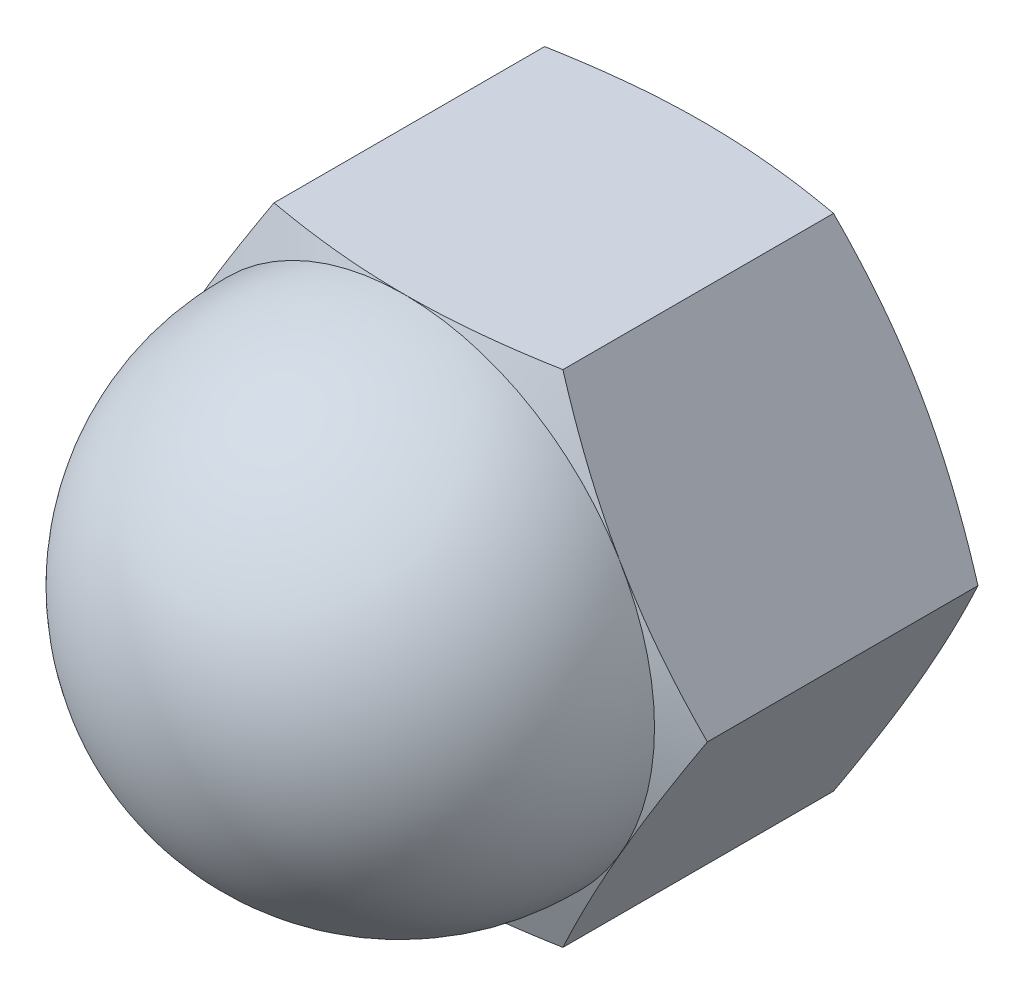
ISO-10303-21;
HEADER;
FILE_DESCRIPTION(('STEP AP214'),'2;1');
FILE_NAME('part.step','',(''),(''),'','','');
FILE_SCHEMA(('AUTOMOTIVE_DESIGN { 1 0 10303 214 1 1 1 1 }'));
ENDSEC;
DATA;
#1=APPLICATION_CONTEXT('core data for automotive mechanical design processes');
#2=APPLICATION_PROTOCOL_DEFINITION('international standard','automotive_design',2000,#1);
#3=PRODUCT_CONTEXT('',#1,'mechanical');
#4=PRODUCT('Part','Part','',(#3));
#5=PRODUCT_RELATED_PRODUCT_CATEGORY('part','',(#4));
#6=PRODUCT_DEFINITION_FORMATION('','',#4);
#7=PRODUCT_DEFINITION_CONTEXT('part definition',#1,'design');
#8=PRODUCT_DEFINITION('design','',#6,#7);
#9=PRODUCT_DEFINITION_SHAPE('','',#8);
#10=(LENGTH_UNIT() NAMED_UNIT(*) SI_UNIT(.MILLI.,.METRE.));
#11=(NAMED_UNIT(*) PLANE_ANGLE_UNIT() SI_UNIT($,.RADIAN.));
#12=(NAMED_UNIT(*) SI_UNIT($,.STERADIAN.) SOLID_ANGLE_UNIT());
#13=UNCERTAINTY_MEASURE_WITH_UNIT(LENGTH_MEASURE(1.E-05),#10,'distance_accuracy_value','');
#14=(GEOMETRIC_REPRESENTATION_CONTEXT(3) GLOBAL_UNCERTAINTY_ASSIGNED_CONTEXT((#13)) GLOBAL_UNIT_ASSIGNED_CONTEXT((#10,
#11,#12)) REPRESENTATION_CONTEXT('',''));
#15=CARTESIAN_POINT('',(0.,0.,0.));
#16=DIRECTION('',(0.,0.,1.));
#17=DIRECTION('',(1.,0.,0.));
#18=AXIS2_PLACEMENT_3D('',#15,#16,#17);
#19=CARTESIAN_POINT('',(0.,0.,-8.));
#20=DIRECTION('',(0.,0.,1.));
#21=DIRECTION('',(1.,0.,0.));
#22=AXIS2_PLACEMENT_3D('',#19,#20,#21);
#23=CYLINDRICAL_SURFACE('',#22,3.3235);
#24=CARTESIAN_POINT('',(0.,0.,-7.1235));
#25=DIRECTION('',(0.,0.,1.));
#26=DIRECTION('',(1.,0.,0.));
#27=AXIS2_PLACEMENT_3D('',#24,#25,#26);
#28=CIRCLE('',#27,3.3235);
#29=CARTESIAN_POINT('',(3.3235,0.,-7.1235));
#30=VERTEX_POINT('',#29);
#31=EDGE_CURVE('E11',#30,#30,#28,.F.);
#32=ORIENTED_EDGE('',*,*,#31,.T.);
#33=EDGE_LOOP('',(#32));
#34=FACE_BOUND('',#33,.T.);
#35=CARTESIAN_POINT('',(0.,0.,-2.));
#36=DIRECTION('',(0.,0.,1.));
#37=DIRECTION('',(1.,0.,0.));
#38=AXIS2_PLACEMENT_3D('',#35,#36,#37);
#39=CIRCLE('',#38,3.3235);
#40=CARTESIAN_POINT('',(3.3235,0.,-2.));
#41=VERTEX_POINT('',#40);
#42=EDGE_CURVE('E124',#41,#41,#39,.F.);
#43=ORIENTED_EDGE('',*,*,#42,.F.);
#44=EDGE_LOOP('',(#43));
#45=FACE_BOUND('',#44,.T.);
#46=ADVANCED_FACE('F30',(#34,#45),#23,.F.);
#47=CARTESIAN_POINT('',(0.,0.,0.));
#48=DIRECTION('',(0.,0.,-1.));
#49=DIRECTION('',(-1.,0.,0.));
#50=AXIS2_PLACEMENT_3D('',#47,#48,#49);
#51=CONICAL_SURFACE('',#50,6.175,1.22173047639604);
#52=CARTESIAN_POINT('',(3.75266127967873,-6.5002,-0.484323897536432));
#53=CARTESIAN_POINT('',(3.90808152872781,-6.23100423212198,-0.427734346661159));
#54=CARTESIAN_POINT('',(4.06401428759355,-5.96092077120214,-0.376256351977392));
#55=CARTESIAN_POINT('',(4.37689369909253,-5.41899773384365,-0.285688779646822));
#56=CARTESIAN_POINT('',(4.53384104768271,-5.14715695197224,-0.246608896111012));
#57=CARTESIAN_POINT('',(4.84700787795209,-4.60473609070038,-0.183398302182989));
#58=CARTESIAN_POINT('',(5.00322020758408,-4.33416839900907,-0.159129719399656));
#59=CARTESIAN_POINT('',(5.31601017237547,-3.79240028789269,-0.126578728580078));
#60=CARTESIAN_POINT('',(5.47258764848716,-3.52120014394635,-0.118290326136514));
#61=CARTESIAN_POINT('',(5.78574260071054,-2.97879985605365,-0.118290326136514));
#62=CARTESIAN_POINT('',(5.94232007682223,-2.7075997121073,-0.126578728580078));
#63=CARTESIAN_POINT('',(6.25511004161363,-2.16583160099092,-0.159129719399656));
#64=CARTESIAN_POINT('',(6.41132237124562,-1.89526390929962,-0.183398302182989));
#65=CARTESIAN_POINT('',(6.72448920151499,-1.35284304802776,-0.246608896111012));
#66=CARTESIAN_POINT('',(6.88143655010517,-1.08100226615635,-0.285688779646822));
#67=CARTESIAN_POINT('',(7.19431596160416,-0.539079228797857,-0.376256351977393));
#68=CARTESIAN_POINT('',(7.35024872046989,-0.268995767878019,-0.427734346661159));
#69=CARTESIAN_POINT('',(7.50566896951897,0.000200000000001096,-0.484323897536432));
#70=B_SPLINE_CURVE_WITH_KNOTS('',3,(#52,#53,#54,#55,#56,#57,#58,#59,#60,#61,#62,#63,#64,#65,#66,
#67,#68,#69),.UNSPECIFIED.,.F.,.F.,(4,2,2,2,2,2,2,2,4),(0.,0.947946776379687,1.89663293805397,
2.83634783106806,3.77571015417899,4.71507247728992,5.65478737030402,6.6034735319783,
7.55142030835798),.UNSPECIFIED.);
#71=CARTESIAN_POINT('',(3.75277674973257,-6.5,-0.484281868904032));
#72=VERTEX_POINT('',#71);
#73=CARTESIAN_POINT('',(7.50555349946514,0.,-0.484281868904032));
#74=VERTEX_POINT('',#73);
#75=EDGE_CURVE('E45',#72,#74,#70,.T.);
#76=ORIENTED_EDGE('',*,*,#75,.T.);
#77=CARTESIAN_POINT('',(7.50566896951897,-0.000199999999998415,-0.484323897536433));
#78=CARTESIAN_POINT('',(7.35024872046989,0.268995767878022,-0.427734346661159));
#79=CARTESIAN_POINT('',(7.19431596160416,0.53907922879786,-0.376256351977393));
#80=CARTESIAN_POINT('',(6.88143655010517,1.08100226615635,-0.285688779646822));
#81=CARTESIAN_POINT('',(6.72448920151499,1.35284304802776,-0.246608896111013));
#82=CARTESIAN_POINT('',(6.41132237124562,1.89526390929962,-0.183398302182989));
#83=CARTESIAN_POINT('',(6.25511004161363,2.16583160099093,-0.159129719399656));
#84=CARTESIAN_POINT('',(5.94232007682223,2.70759971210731,-0.126578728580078));
#85=CARTESIAN_POINT('',(5.78574260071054,2.97879985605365,-0.118290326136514));
#86=CARTESIAN_POINT('',(5.47258764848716,3.52120014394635,-0.118290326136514));
#87=CARTESIAN_POINT('',(5.31601017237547,3.79240028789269,-0.126578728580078));
#88=CARTESIAN_POINT('',(5.00322020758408,4.33416839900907,-0.159129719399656));
#89=CARTESIAN_POINT('',(4.84700787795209,4.60473609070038,-0.183398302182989));
#90=CARTESIAN_POINT('',(4.53384104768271,5.14715695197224,-0.246608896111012));
#91=CARTESIAN_POINT('',(4.37689369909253,5.41899773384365,-0.285688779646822));
#92=CARTESIAN_POINT('',(4.06401428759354,5.96092077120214,-0.376256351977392));
#93=CARTESIAN_POINT('',(3.90808152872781,6.23100423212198,-0.427734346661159));
#94=CARTESIAN_POINT('',(3.75266127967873,6.5002,-0.484323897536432));
#95=B_SPLINE_CURVE_WITH_KNOTS('',3,(#77,#78,#79,#80,#81,#82,#83,#84,#85,#86,#87,#88,#89,#90,#91,
#92,#93,#94),.UNSPECIFIED.,.F.,.F.,(4,2,2,2,2,2,2,2,4),(0.,0.947946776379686,1.89663293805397,
2.83634783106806,3.77571015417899,4.71507247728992,5.65478737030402,6.6034735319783,
7.55142030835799),.UNSPECIFIED.);
#96=CARTESIAN_POINT('',(3.75277674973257,6.5,-0.484281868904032));
#97=VERTEX_POINT('',#96);
#98=EDGE_CURVE('E190',#74,#97,#95,.T.);
#99=ORIENTED_EDGE('',*,*,#98,.T.);
#100=CARTESIAN_POINT('',(-9.9247690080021,6.5,-2.07057364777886));
#101=CARTESIAN_POINT('',(-9.63080077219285,6.5,-1.98109093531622));
#102=CARTESIAN_POINT('',(-9.33650800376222,6.5,-1.89265487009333));
#103=CARTESIAN_POINT('',(-8.74710820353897,6.5,-1.71845507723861));
#104=CARTESIAN_POINT('',(-8.45200110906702,6.5,-1.6326915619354));
#105=CARTESIAN_POINT('',(-7.86029986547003,6.5,-1.46427255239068));
#106=CARTESIAN_POINT('',(-7.56370396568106,6.5,-1.38162318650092));
#107=CARTESIAN_POINT('',(-6.96940726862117,6.5,-1.22040301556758));
#108=CARTESIAN_POINT('',(-6.67170649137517,6.5,-1.14183213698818));
#109=CARTESIAN_POINT('',(-6.07870150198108,6.5,-0.990721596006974));
#110=CARTESIAN_POINT('',(-5.78341334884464,6.5,-0.918119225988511));
#111=CARTESIAN_POINT('',(-5.19136638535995,6.5,-0.77911271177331));
#112=CARTESIAN_POINT('',(-4.8946075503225,6.5,-0.712708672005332));
#113=CARTESIAN_POINT('',(-4.29955488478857,6.5,-0.587650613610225));
#114=CARTESIAN_POINT('',(-4.00126162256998,6.5,-0.528993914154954));
#115=CARTESIAN_POINT('',(-3.40294390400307,6.5,-0.421219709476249));
#116=CARTESIAN_POINT('',(-3.10291950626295,6.5,-0.372101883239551));
#117=CARTESIAN_POINT('',(-2.53494395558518,6.5,-0.290267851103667));
#118=CARTESIAN_POINT('',(-2.26717049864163,6.5,-0.256329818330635));
#119=CARTESIAN_POINT('',(-1.73049474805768,6.5,-0.19891835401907));
#120=CARTESIAN_POINT('',(-1.46159248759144,6.5,-0.175444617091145));
#121=CARTESIAN_POINT('',(-0.923204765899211,6.5,-0.140092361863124));
#122=CARTESIAN_POINT('',(-0.653719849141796,6.5,-0.12820568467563));
#123=CARTESIAN_POINT('',(-0.11448535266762,6.5,-0.116629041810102));
#124=CARTESIAN_POINT('',(0.155264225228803,6.5,-0.116938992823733));
#125=CARTESIAN_POINT('',(0.695845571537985,6.5,-0.129771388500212));
#126=CARTESIAN_POINT('',(0.966675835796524,6.5,-0.142356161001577));
#127=CARTESIAN_POINT('',(1.50753788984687,6.5,-0.179159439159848));
#128=CARTESIAN_POINT('',(1.77756966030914,6.5,-0.203378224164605));
#129=CARTESIAN_POINT('',(2.3167026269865,6.5,-0.262318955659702));
#130=CARTESIAN_POINT('',(2.58580282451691,6.5,-0.297049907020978));
#131=CARTESIAN_POINT('',(3.12265688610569,6.5,-0.375609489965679));
#132=CARTESIAN_POINT('',(3.39041074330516,6.5,-0.419438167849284));
#133=CARTESIAN_POINT('',(3.93952468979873,6.5,-0.517445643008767));
#134=CARTESIAN_POINT('',(4.22080504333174,6.5,-0.572067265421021));
#135=CARTESIAN_POINT('',(4.78191853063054,6.5,-0.688339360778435));
#136=CARTESIAN_POINT('',(5.06175155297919,6.5,-0.749990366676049));
#137=CARTESIAN_POINT('',(5.62017127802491,6.5,-0.879023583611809));
#138=CARTESIAN_POINT('',(5.89875759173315,6.5,-0.946407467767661));
#139=CARTESIAN_POINT('',(6.45475564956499,6.5,-1.08580883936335));
#140=CARTESIAN_POINT('',(6.73216742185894,6.5,-1.15782621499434));
#141=CARTESIAN_POINT('',(7.28633795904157,6.5,-1.30572012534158));
#142=CARTESIAN_POINT('',(7.56309543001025,6.5,-1.38160149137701));
#143=CARTESIAN_POINT('',(8.11574738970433,6.5,-1.53644994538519));
#144=CARTESIAN_POINT('',(8.39164186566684,6.5,-1.61541707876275));
#145=CARTESIAN_POINT('',(9.21812610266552,6.5,-1.85606038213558));
#146=CARTESIAN_POINT('',(9.76761763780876,6.5,-2.02150586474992));
#147=CARTESIAN_POINT('',(10.8583177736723,6.5,-2.35739038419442));
#148=CARTESIAN_POINT('',(11.3995501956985,6.5,-2.52775269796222));
#149=CARTESIAN_POINT('',(12.4804982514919,6.5,-2.87330195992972));
#150=CARTESIAN_POINT('',(13.0202138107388,6.5,-3.04848914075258));
#151=CARTESIAN_POINT('',(14.0964375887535,6.5,-3.4017162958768));
#152=CARTESIAN_POINT('',(14.632950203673,6.5,-3.57974290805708));
#153=CARTESIAN_POINT('',(15.4370350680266,6.5,-3.84875140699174));
#154=CARTESIAN_POINT('',(15.7049385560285,6.5,-3.93874533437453));
#155=CARTESIAN_POINT('',(16.2405492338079,6.5,-4.11931340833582));
#156=CARTESIAN_POINT('',(16.5082564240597,6.5,-4.20988755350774));
#157=CARTESIAN_POINT('',(16.775878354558,6.5,-4.30071288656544));
#158=B_SPLINE_CURVE_WITH_KNOTS('',3,(#100,#101,#102,#103,#104,#105,#106,#107,#108,#109,#110,
#111,#112,#113,#114,#115,#116,#117,#118,#119,#120,#121,#122,#123,#124,#125,#126,#127,#128,#129,
#130,#131,#132,#133,#134,#135,#136,#137,#138,#139,#140,#141,#142,#143,#144,#145,#146,#147,#148,
#149,#150,#151,#152,#153,#154,#155,#156,#157),.UNSPECIFIED.,.F.,.F.,(4,2,2,2,2,2,2,2,2,2,2,2,2,
2,2,2,2,2,2,2,2,2,2,2,2,2,2,2,4),(0.,0.92186355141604,1.84380015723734,2.76746520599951,
3.69111359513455,4.60330838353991,5.51551853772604,6.42741220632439,7.33927518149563,
8.14884381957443,8.95838882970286,9.76736339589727,10.5763324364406,11.3894306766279,
12.202548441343,13.0163647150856,13.8301851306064,14.6896790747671,15.5492382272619,
16.4090491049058,17.2688392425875,18.1297321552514,18.9906377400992,20.7121351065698,
22.4143434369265,24.1166339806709,25.8124591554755,26.6603033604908,27.5081455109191),.UNSPECIFIED.);
#159=CARTESIAN_POINT('',(-3.75277674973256,6.5,-0.484281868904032));
#160=VERTEX_POINT('',#159);
#161=EDGE_CURVE('E88',#97,#160,#158,.F.);
#162=ORIENTED_EDGE('',*,*,#161,.T.);
#163=CARTESIAN_POINT('',(-3.75266127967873,6.5002,-0.484323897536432));
#164=CARTESIAN_POINT('',(-3.90808152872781,6.23100423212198,-0.427734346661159));
#165=CARTESIAN_POINT('',(-4.06401428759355,5.96092077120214,-0.376256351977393));
#166=CARTESIAN_POINT('',(-4.37689369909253,5.41899773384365,-0.285688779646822));
#167=CARTESIAN_POINT('',(-4.53384104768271,5.14715695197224,-0.246608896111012));
#168=CARTESIAN_POINT('',(-4.84700787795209,4.60473609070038,-0.183398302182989));
#169=CARTESIAN_POINT('',(-5.00322020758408,4.33416839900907,-0.159129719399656));
#170=CARTESIAN_POINT('',(-5.31601017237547,3.7924002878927,-0.126578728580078));
#171=CARTESIAN_POINT('',(-5.47258764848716,3.52120014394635,-0.118290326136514));
#172=CARTESIAN_POINT('',(-5.78574260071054,2.97879985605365,-0.118290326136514));
#173=CARTESIAN_POINT('',(-5.94232007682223,2.70759971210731,-0.126578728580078));
#174=CARTESIAN_POINT('',(-6.25511004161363,2.16583160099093,-0.159129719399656));
#175=CARTESIAN_POINT('',(-6.41132237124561,1.89526390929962,-0.183398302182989));
#176=CARTESIAN_POINT('',(-6.72448920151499,1.35284304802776,-0.246608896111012));
#177=CARTESIAN_POINT('',(-6.88143655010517,1.08100226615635,-0.285688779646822));
#178=CARTESIAN_POINT('',(-7.19431596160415,0.53907922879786,-0.376256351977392));
#179=CARTESIAN_POINT('',(-7.35024872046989,0.268995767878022,-0.427734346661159));
#180=CARTESIAN_POINT('',(-7.50566896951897,-0.000199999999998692,-0.484323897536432));
#181=B_SPLINE_CURVE_WITH_KNOTS('',3,(#163,#164,#165,#166,#167,#168,#169,#170,#171,#172,#173,
#174,#175,#176,#177,#178,#179,#180),.UNSPECIFIED.,.F.,.F.,(4,2,2,2,2,2,2,2,4),(0.,
0.947946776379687,1.89663293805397,2.83634783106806,3.77571015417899,4.71507247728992,
5.65478737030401,6.6034735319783,7.55142030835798),.UNSPECIFIED.);
#182=CARTESIAN_POINT('',(-7.50555349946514,0.,-0.484281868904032));
#183=VERTEX_POINT('',#182);
#184=EDGE_CURVE('E81',#160,#183,#181,.T.);
#185=ORIENTED_EDGE('',*,*,#184,.T.);
#186=CARTESIAN_POINT('',(-7.50566896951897,0.000200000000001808,-0.484323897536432));
#187=CARTESIAN_POINT('',(-7.35024872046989,-0.268995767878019,-0.427734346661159));
#188=CARTESIAN_POINT('',(-7.19431596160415,-0.539079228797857,-0.376256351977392));
#189=CARTESIAN_POINT('',(-6.88143655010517,-1.08100226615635,-0.285688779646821));
#190=CARTESIAN_POINT('',(-6.72448920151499,-1.35284304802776,-0.246608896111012));
#191=CARTESIAN_POINT('',(-6.41132237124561,-1.89526390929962,-0.183398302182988));
#192=CARTESIAN_POINT('',(-6.25511004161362,-2.16583160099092,-0.159129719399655));
#193=CARTESIAN_POINT('',(-5.94232007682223,-2.7075997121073,-0.126578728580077));
#194=CARTESIAN_POINT('',(-5.78574260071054,-2.97879985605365,-0.118290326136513));
#195=CARTESIAN_POINT('',(-5.47258764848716,-3.52120014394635,-0.118290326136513));
#196=CARTESIAN_POINT('',(-5.31601017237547,-3.79240028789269,-0.126578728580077));
#197=CARTESIAN_POINT('',(-5.00322020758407,-4.33416839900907,-0.159129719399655));
#198=CARTESIAN_POINT('',(-4.84700787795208,-4.60473609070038,-0.183398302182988));
#199=CARTESIAN_POINT('',(-4.53384104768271,-5.14715695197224,-0.246608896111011));
#200=CARTESIAN_POINT('',(-4.37689369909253,-5.41899773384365,-0.28568877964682));
#201=CARTESIAN_POINT('',(-4.06401428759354,-5.96092077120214,-0.376256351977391));
#202=CARTESIAN_POINT('',(-3.90808152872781,-6.23100423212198,-0.427734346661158));
#203=CARTESIAN_POINT('',(-3.75266127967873,-6.5002,-0.484323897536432));
#204=B_SPLINE_CURVE_WITH_KNOTS('',3,(#186,#187,#188,#189,#190,#191,#192,#193,#194,#195,#196,
#197,#198,#199,#200,#201,#202,#203),.UNSPECIFIED.,.F.,.F.,(4,2,2,2,2,2,2,2,4),(0.,
0.947946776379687,1.89663293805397,2.83634783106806,3.77571015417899,4.71507247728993,
5.65478737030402,6.6034735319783,7.55142030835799),.UNSPECIFIED.);
#205=CARTESIAN_POINT('',(-3.75277674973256,-6.5,-0.484281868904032));
#206=VERTEX_POINT('',#205);
#207=EDGE_CURVE('E85',#183,#206,#204,.T.);
#208=ORIENTED_EDGE('',*,*,#207,.T.);
#209=CARTESIAN_POINT('',(-9.92476900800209,-6.5,-2.07057364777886));
#210=CARTESIAN_POINT('',(-9.63080077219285,-6.5,-1.98109093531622));
#211=CARTESIAN_POINT('',(-9.33650800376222,-6.5,-1.89265487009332));
#212=CARTESIAN_POINT('',(-8.74710820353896,-6.5,-1.7184550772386));
#213=CARTESIAN_POINT('',(-8.45200110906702,-6.5,-1.6326915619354));
#214=CARTESIAN_POINT('',(-7.86029986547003,-6.5,-1.46427255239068));
#215=CARTESIAN_POINT('',(-7.56370396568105,-6.5,-1.38162318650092));
#216=CARTESIAN_POINT('',(-6.96940726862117,-6.5,-1.22040301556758));
#217=CARTESIAN_POINT('',(-6.67170649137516,-6.5,-1.14183213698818));
#218=CARTESIAN_POINT('',(-6.07870150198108,-6.5,-0.990721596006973));
#219=CARTESIAN_POINT('',(-5.78341334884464,-6.5,-0.91811922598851));
#220=CARTESIAN_POINT('',(-5.19136638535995,-6.5,-0.779112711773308));
#221=CARTESIAN_POINT('',(-4.89460755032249,-6.5,-0.71270867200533));
#222=CARTESIAN_POINT('',(-4.29955488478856,-6.5,-0.587650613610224));
#223=CARTESIAN_POINT('',(-4.00126162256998,-6.5,-0.528993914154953));
#224=CARTESIAN_POINT('',(-3.40294390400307,-6.5,-0.421219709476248));
#225=CARTESIAN_POINT('',(-3.10291950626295,-6.5,-0.37210188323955));
#226=CARTESIAN_POINT('',(-2.53494395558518,-6.5,-0.290267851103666));
#227=CARTESIAN_POINT('',(-2.26717049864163,-6.5,-0.256329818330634));
#228=CARTESIAN_POINT('',(-1.73049474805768,-6.5,-0.198918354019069));
#229=CARTESIAN_POINT('',(-1.46159248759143,-6.5,-0.175444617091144));
#230=CARTESIAN_POINT('',(-0.923204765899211,-6.5,-0.140092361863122));
#231=CARTESIAN_POINT('',(-0.653719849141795,-6.5,-0.128205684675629));
#232=CARTESIAN_POINT('',(-0.11448535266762,-6.5,-0.116629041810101));
#233=CARTESIAN_POINT('',(0.155264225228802,-6.5,-0.116938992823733));
#234=CARTESIAN_POINT('',(0.695845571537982,-6.5,-0.129771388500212));
#235=CARTESIAN_POINT('',(0.96667583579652,-6.5,-0.142356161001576));
#236=CARTESIAN_POINT('',(1.50753788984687,-6.5,-0.179159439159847));
#237=CARTESIAN_POINT('',(1.77756966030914,-6.5,-0.203378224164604));
#238=CARTESIAN_POINT('',(2.3167026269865,-6.5,-0.2623189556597));
#239=CARTESIAN_POINT('',(2.58580282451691,-6.5,-0.297049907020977));
#240=CARTESIAN_POINT('',(3.12265688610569,-6.5,-0.375609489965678));
#241=CARTESIAN_POINT('',(3.39041074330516,-6.5,-0.419438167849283));
#242=CARTESIAN_POINT('',(3.93952468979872,-6.5,-0.517445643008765));
#243=CARTESIAN_POINT('',(4.22080504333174,-6.5,-0.572067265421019));
#244=CARTESIAN_POINT('',(4.78191853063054,-6.5,-0.688339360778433));
#245=CARTESIAN_POINT('',(5.06175155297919,-6.5,-0.749990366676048));
#246=CARTESIAN_POINT('',(5.62017127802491,-6.5,-0.879023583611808));
#247=CARTESIAN_POINT('',(5.89875759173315,-6.5,-0.946407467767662));
#248=CARTESIAN_POINT('',(6.454755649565,-6.5,-1.08580883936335));
#249=CARTESIAN_POINT('',(6.73216742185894,-6.5,-1.15782621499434));
#250=CARTESIAN_POINT('',(7.28633795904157,-6.5,-1.30572012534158));
#251=CARTESIAN_POINT('',(7.56309543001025,-6.5,-1.38160149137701));
#252=CARTESIAN_POINT('',(8.11574738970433,-6.5,-1.53644994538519));
#253=CARTESIAN_POINT('',(8.39164186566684,-6.5,-1.61541707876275));
#254=CARTESIAN_POINT('',(9.21812610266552,-6.5,-1.85606038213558));
#255=CARTESIAN_POINT('',(9.76761763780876,-6.5,-2.02150586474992));
#256=CARTESIAN_POINT('',(10.8583177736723,-6.5,-2.35739038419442));
#257=CARTESIAN_POINT('',(11.3995501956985,-6.5,-2.52775269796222));
#258=CARTESIAN_POINT('',(12.4804982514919,-6.5,-2.87330195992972));
#259=CARTESIAN_POINT('',(13.0202138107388,-6.5,-3.04848914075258));
#260=CARTESIAN_POINT('',(14.0964375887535,-6.5,-3.4017162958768));
#261=CARTESIAN_POINT('',(14.632950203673,-6.5,-3.57974290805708));
#262=CARTESIAN_POINT('',(15.4370350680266,-6.5,-3.84875140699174));
#263=CARTESIAN_POINT('',(15.7049385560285,-6.5,-3.93874533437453));
#264=CARTESIAN_POINT('',(16.2405492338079,-6.5,-4.11931340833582));
#265=CARTESIAN_POINT('',(16.5082564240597,-6.5,-4.20988755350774));
#266=CARTESIAN_POINT('',(16.775878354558,-6.5,-4.30071288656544));
#267=B_SPLINE_CURVE_WITH_KNOTS('',3,(#209,#210,#211,#212,#213,#214,#215,#216,#217,#218,#219,
#220,#221,#222,#223,#224,#225,#226,#227,#228,#229,#230,#231,#232,#233,#234,#235,#236,#237,#238,
#239,#240,#241,#242,#243,#244,#245,#246,#247,#248,#249,#250,#251,#252,#253,#254,#255,#256,#257,
#258,#259,#260,#261,#262,#263,#264,#265,#266),.UNSPECIFIED.,.F.,.F.,(4,2,2,2,2,2,2,2,2,2,2,2,2,
2,2,2,2,2,2,2,2,2,2,2,2,2,2,2,4),(0.,0.92186355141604,1.84380015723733,2.76746520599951,
3.69111359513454,4.60330838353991,5.51551853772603,6.42741220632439,7.33927518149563,
8.14884381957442,8.95838882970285,9.76736339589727,10.5763324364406,11.3894306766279,
12.202548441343,13.0163647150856,13.8301851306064,14.6896790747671,15.5492382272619,
16.4090491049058,17.2688392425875,18.1297321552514,18.9906377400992,20.7121351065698,
22.4143434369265,24.1166339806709,25.8124591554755,26.6603033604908,27.5081455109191),.UNSPECIFIED.);
#268=EDGE_CURVE('E102',#206,#72,#267,.T.);
#269=ORIENTED_EDGE('',*,*,#268,.T.);
#270=EDGE_LOOP('',(#76,#99,#162,#185,#208,#269));
#271=FACE_BOUND('',#270,.T.);
#272=CARTESIAN_POINT('',(0.,0.,-0.117901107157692));
#273=DIRECTION('',(0.,0.,1.));
#274=DIRECTION('',(1.,0.,0.));
#275=AXIS2_PLACEMENT_3D('',#272,#273,#274);
#276=CIRCLE('',#275,6.49893062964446);
#277=CARTESIAN_POINT('',(6.49893062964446,0.,-0.117901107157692));
#278=VERTEX_POINT('',#277);
#279=EDGE_CURVE('E121',#278,#278,#276,.T.);
#280=ORIENTED_EDGE('',*,*,#279,.F.);
#281=EDGE_LOOP('',(#280));
#282=FACE_BOUND('',#281,.T.);
#283=ADVANCED_FACE('F83',(#271,#282),#51,.T.);
#284=CARTESIAN_POINT('',(3.75277674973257,-6.5,-8.));
#285=DIRECTION('',(0.866025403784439,-0.5,0.));
#286=DIRECTION('',(0.5,0.866025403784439,0.));
#287=AXIS2_PLACEMENT_3D('',#284,#285,#286);
#288=PLANE('',#287);
#289=ORIENTED_EDGE('',*,*,#75,.F.);
#290=DIRECTION('',(0.,0.,1.));
#291=VECTOR('',#290,1.);
#292=CARTESIAN_POINT('',(3.75277674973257,-6.5,-8.));
#293=LINE('',#292,#291);
#294=CARTESIAN_POINT('',(3.75277674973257,-6.5,-7.51571813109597));
#295=VERTEX_POINT('',#294);
#296=EDGE_CURVE('E109',#295,#72,#293,.T.);
#297=ORIENTED_EDGE('',*,*,#296,.F.);
#298=CARTESIAN_POINT('',(7.50566896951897,0.000200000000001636,-7.51567610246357));
#299=CARTESIAN_POINT('',(7.35024872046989,-0.268995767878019,-7.57226565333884));
#300=CARTESIAN_POINT('',(7.19431596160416,-0.539079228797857,-7.62374364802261));
#301=CARTESIAN_POINT('',(6.88143655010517,-1.08100226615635,-7.71431122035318));
#302=CARTESIAN_POINT('',(6.72448920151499,-1.35284304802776,-7.75339110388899));
#303=CARTESIAN_POINT('',(6.41132237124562,-1.89526390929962,-7.81660169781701));
#304=CARTESIAN_POINT('',(6.25511004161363,-2.16583160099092,-7.84087028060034));
#305=CARTESIAN_POINT('',(5.94232007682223,-2.7075997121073,-7.87342127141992));
#306=CARTESIAN_POINT('',(5.78574260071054,-2.97879985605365,-7.88170967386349));
#307=CARTESIAN_POINT('',(5.47258764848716,-3.52120014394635,-7.88170967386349));
#308=CARTESIAN_POINT('',(5.31601017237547,-3.79240028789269,-7.87342127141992));
#309=CARTESIAN_POINT('',(5.00322020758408,-4.33416839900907,-7.84087028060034));
#310=CARTESIAN_POINT('',(4.84700787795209,-4.60473609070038,-7.81660169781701));
#311=CARTESIAN_POINT('',(4.53384104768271,-5.14715695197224,-7.75339110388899));
#312=CARTESIAN_POINT('',(4.37689369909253,-5.41899773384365,-7.71431122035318));
#313=CARTESIAN_POINT('',(4.06401428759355,-5.96092077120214,-7.62374364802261));
#314=CARTESIAN_POINT('',(3.90808152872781,-6.23100423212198,-7.57226565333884));
#315=CARTESIAN_POINT('',(3.75266127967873,-6.5002,-7.51567610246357));
#316=B_SPLINE_CURVE_WITH_KNOTS('',3,(#298,#299,#300,#301,#302,#303,#304,#305,#306,#307,#308,
#309,#310,#311,#312,#313,#314,#315),.UNSPECIFIED.,.F.,.F.,(4,2,2,2,2,2,2,2,4),(0.,
0.947946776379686,1.89663293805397,2.83634783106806,3.77571015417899,4.71507247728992,
5.65478737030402,6.6034735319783,7.55142030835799),.UNSPECIFIED.);
#317=CARTESIAN_POINT('',(7.50555349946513,0.,-7.51571813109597));
#318=VERTEX_POINT('',#317);
#319=EDGE_CURVE('E120',#318,#295,#316,.T.);
#320=ORIENTED_EDGE('',*,*,#319,.F.);
#321=DIRECTION('',(0.,0.,1.));
#322=VECTOR('',#321,1.);
#323=CARTESIAN_POINT('',(7.50555349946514,0.,-8.));
#324=LINE('',#323,#322);
#325=EDGE_CURVE('E117',#318,#74,#324,.T.);
#326=ORIENTED_EDGE('',*,*,#325,.T.);
#327=EDGE_LOOP('',(#289,#297,#320,#326));
#328=FACE_BOUND('',#327,.T.);
#329=ADVANCED_FACE('F148',(#328),#288,.T.);
#330=CARTESIAN_POINT('',(-3.75277674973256,-6.5,-8.));
#331=DIRECTION('',(0.,-1.,0.));
#332=DIRECTION('',(0.,0.,-1.));
#333=AXIS2_PLACEMENT_3D('',#330,#331,#332);
#334=PLANE('',#333);
#335=ORIENTED_EDGE('',*,*,#268,.F.);
#336=DIRECTION('',(0.,0.,1.));
#337=VECTOR('',#336,1.);
#338=CARTESIAN_POINT('',(-3.75277674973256,-6.5,-8.));
#339=LINE('',#338,#337);
#340=CARTESIAN_POINT('',(-3.75277674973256,-6.5,-7.51571813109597));
#341=VERTEX_POINT('',#340);
#342=EDGE_CURVE('E101',#341,#206,#339,.T.);
#343=ORIENTED_EDGE('',*,*,#342,.F.);
#344=CARTESIAN_POINT('',(-9.92476900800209,-6.5,-5.92942635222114));
#345=CARTESIAN_POINT('',(-9.63080077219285,-6.5,-6.01890906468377));
#346=CARTESIAN_POINT('',(-9.33650800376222,-6.5,-6.10734512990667));
#347=CARTESIAN_POINT('',(-8.74710820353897,-6.5,-6.28154492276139));
#348=CARTESIAN_POINT('',(-8.45200110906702,-6.5,-6.3673084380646));
#349=CARTESIAN_POINT('',(-7.86029986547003,-6.5,-6.53572744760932));
#350=CARTESIAN_POINT('',(-7.56370396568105,-6.5,-6.61837681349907));
#351=CARTESIAN_POINT('',(-6.96940726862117,-6.5,-6.77959698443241));
#352=CARTESIAN_POINT('',(-6.67170649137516,-6.5,-6.85816786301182));
#353=CARTESIAN_POINT('',(-6.07870150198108,-6.5,-7.00927840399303));
#354=CARTESIAN_POINT('',(-5.78341334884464,-6.5,-7.08188077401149));
#355=CARTESIAN_POINT('',(-5.19136638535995,-6.5,-7.22088728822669));
#356=CARTESIAN_POINT('',(-4.8946075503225,-6.5,-7.28729132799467));
#357=CARTESIAN_POINT('',(-4.29955488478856,-6.5,-7.41234938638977));
#358=CARTESIAN_POINT('',(-4.00126162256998,-6.5,-7.47100608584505));
#359=CARTESIAN_POINT('',(-3.40294390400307,-6.5,-7.57878029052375));
#360=CARTESIAN_POINT('',(-3.10291950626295,-6.5,-7.62789811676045));
#361=CARTESIAN_POINT('',(-2.53494395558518,-6.5,-7.70973214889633));
#362=CARTESIAN_POINT('',(-2.26717049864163,-6.5,-7.74367018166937));
#363=CARTESIAN_POINT('',(-1.73049474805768,-6.5,-7.80108164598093));
#364=CARTESIAN_POINT('',(-1.46159248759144,-6.5,-7.82455538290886));
#365=CARTESIAN_POINT('',(-0.923204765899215,-6.5,-7.85990763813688));
#366=CARTESIAN_POINT('',(-0.6537198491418,-6.5,-7.87179431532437));
#367=CARTESIAN_POINT('',(-0.114485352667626,-6.5,-7.8833709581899));
#368=CARTESIAN_POINT('',(0.155264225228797,-6.5,-7.88306100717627));
#369=CARTESIAN_POINT('',(0.695845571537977,-6.5,-7.87022861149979));
#370=CARTESIAN_POINT('',(0.966675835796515,-6.5,-7.85764383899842));
#371=CARTESIAN_POINT('',(1.50753788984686,-6.5,-7.82084056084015));
#372=CARTESIAN_POINT('',(1.77756966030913,-6.5,-7.7966217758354));
#373=CARTESIAN_POINT('',(2.31670262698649,-6.5,-7.7376810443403));
#374=CARTESIAN_POINT('',(2.5858028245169,-6.5,-7.70295009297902));
#375=CARTESIAN_POINT('',(3.12265688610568,-6.5,-7.62439051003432));
#376=CARTESIAN_POINT('',(3.39041074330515,-6.5,-7.58056183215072));
#377=CARTESIAN_POINT('',(3.93952468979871,-6.5,-7.48255435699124));
#378=CARTESIAN_POINT('',(4.22080504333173,-6.5,-7.42793273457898));
#379=CARTESIAN_POINT('',(4.78191853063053,-6.5,-7.31166063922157));
#380=CARTESIAN_POINT('',(5.06175155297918,-6.5,-7.25000963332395));
#381=CARTESIAN_POINT('',(5.6201712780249,-6.5,-7.12097641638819));
#382=CARTESIAN_POINT('',(5.89875759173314,-6.5,-7.05359253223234));
#383=CARTESIAN_POINT('',(6.45475564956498,-6.5,-6.91419116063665));
#384=CARTESIAN_POINT('',(6.73216742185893,-6.5,-6.84217378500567));
#385=CARTESIAN_POINT('',(7.28633795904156,-6.5,-6.69427987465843));
#386=CARTESIAN_POINT('',(7.56309543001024,-6.5,-6.61839850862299));
#387=CARTESIAN_POINT('',(8.11574738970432,-6.5,-6.46355005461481));
#388=CARTESIAN_POINT('',(8.39164186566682,-6.5,-6.38458292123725));
#389=CARTESIAN_POINT('',(9.2181261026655,-6.5,-6.14393961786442));
#390=CARTESIAN_POINT('',(9.76761763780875,-6.5,-5.97849413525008));
#391=CARTESIAN_POINT('',(10.8583177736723,-6.5,-5.64260961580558));
#392=CARTESIAN_POINT('',(11.3995501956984,-6.5,-5.47224730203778));
#393=CARTESIAN_POINT('',(12.4804982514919,-6.5,-5.12669804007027));
#394=CARTESIAN_POINT('',(13.0202138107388,-6.5,-4.95151085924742));
#395=CARTESIAN_POINT('',(14.0964375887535,-6.5,-4.5982837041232));
#396=CARTESIAN_POINT('',(14.632950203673,-6.5,-4.42025709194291));
#397=CARTESIAN_POINT('',(15.4370350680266,-6.5,-4.15124859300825));
#398=CARTESIAN_POINT('',(15.7049385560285,-6.5,-4.06125466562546));
#399=CARTESIAN_POINT('',(16.2405492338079,-6.5,-3.88068659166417));
#400=CARTESIAN_POINT('',(16.5082564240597,-6.5,-3.79011244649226));
#401=CARTESIAN_POINT('',(16.775878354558,-6.5,-3.69928711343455));
#402=B_SPLINE_CURVE_WITH_KNOTS('',3,(#344,#345,#346,#347,#348,#349,#350,#351,#352,#353,#354,
#355,#356,#357,#358,#359,#360,#361,#362,#363,#364,#365,#366,#367,#368,#369,#370,#371,#372,#373,
#374,#375,#376,#377,#378,#379,#380,#381,#382,#383,#384,#385,#386,#387,#388,#389,#390,#391,#392,
#393,#394,#395,#396,#397,#398,#399,#400,#401),.UNSPECIFIED.,.F.,.F.,(4,2,2,2,2,2,2,2,2,2,2,2,2,
2,2,2,2,2,2,2,2,2,2,2,2,2,2,2,4),(0.,0.921863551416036,1.84380015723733,2.76746520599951,
3.69111359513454,4.60330838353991,5.51551853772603,6.42741220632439,7.33927518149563,
8.14884381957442,8.95838882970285,9.76736339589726,10.5763324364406,11.3894306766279,
12.202548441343,13.0163647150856,13.8301851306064,14.6896790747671,15.5492382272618,
16.4090491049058,17.2688392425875,18.1297321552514,18.9906377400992,20.7121351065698,
22.4143434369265,24.1166339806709,25.8124591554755,26.6603033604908,27.5081455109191),.UNSPECIFIED.);
#403=EDGE_CURVE('E167',#295,#341,#402,.F.);
#404=ORIENTED_EDGE('',*,*,#403,.F.);
#405=ORIENTED_EDGE('',*,*,#296,.T.);
#406=EDGE_LOOP('',(#335,#343,#404,#405));
#407=FACE_BOUND('',#406,.T.);
#408=ADVANCED_FACE('F158',(#407),#334,.T.);
#409=CARTESIAN_POINT('',(-7.50555349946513,0.,-8.));
#410=DIRECTION('',(-0.866025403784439,-0.5,0.));
#411=DIRECTION('',(0.5,-0.866025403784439,0.));
#412=AXIS2_PLACEMENT_3D('',#409,#410,#411);
#413=PLANE('',#412);
#414=ORIENTED_EDGE('',*,*,#207,.F.);
#415=DIRECTION('',(0.,0.,1.));
#416=VECTOR('',#415,1.);
#417=CARTESIAN_POINT('',(-7.50555349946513,0.,-8.));
#418=LINE('',#417,#416);
#419=CARTESIAN_POINT('',(-7.50555349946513,0.,-7.51571813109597));
#420=VERTEX_POINT('',#419);
#421=EDGE_CURVE('E99',#420,#183,#418,.T.);
#422=ORIENTED_EDGE('',*,*,#421,.F.);
#423=CARTESIAN_POINT('',(-3.75266127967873,-6.5002,-7.51567610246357));
#424=CARTESIAN_POINT('',(-3.90808152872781,-6.23100423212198,-7.57226565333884));
#425=CARTESIAN_POINT('',(-4.06401428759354,-5.96092077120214,-7.62374364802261));
#426=CARTESIAN_POINT('',(-4.37689369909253,-5.41899773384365,-7.71431122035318));
#427=CARTESIAN_POINT('',(-4.53384104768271,-5.14715695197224,-7.75339110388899));
#428=CARTESIAN_POINT('',(-4.84700787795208,-4.60473609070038,-7.81660169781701));
#429=CARTESIAN_POINT('',(-5.00322020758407,-4.33416839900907,-7.84087028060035));
#430=CARTESIAN_POINT('',(-5.31601017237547,-3.79240028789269,-7.87342127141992));
#431=CARTESIAN_POINT('',(-5.47258764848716,-3.52120014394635,-7.88170967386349));
#432=CARTESIAN_POINT('',(-5.78574260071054,-2.97879985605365,-7.88170967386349));
#433=CARTESIAN_POINT('',(-5.94232007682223,-2.7075997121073,-7.87342127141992));
#434=CARTESIAN_POINT('',(-6.25511004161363,-2.16583160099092,-7.84087028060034));
#435=CARTESIAN_POINT('',(-6.41132237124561,-1.89526390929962,-7.81660169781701));
#436=CARTESIAN_POINT('',(-6.72448920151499,-1.35284304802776,-7.75339110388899));
#437=CARTESIAN_POINT('',(-6.88143655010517,-1.08100226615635,-7.71431122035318));
#438=CARTESIAN_POINT('',(-7.19431596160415,-0.539079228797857,-7.62374364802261));
#439=CARTESIAN_POINT('',(-7.35024872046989,-0.268995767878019,-7.57226565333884));
#440=CARTESIAN_POINT('',(-7.50566896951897,0.000200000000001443,-7.51567610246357));
#441=B_SPLINE_CURVE_WITH_KNOTS('',3,(#423,#424,#425,#426,#427,#428,#429,#430,#431,#432,#433,
#434,#435,#436,#437,#438,#439,#440),.UNSPECIFIED.,.F.,.F.,(4,2,2,2,2,2,2,2,4),(0.,
0.947946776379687,1.89663293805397,2.83634783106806,3.77571015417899,4.71507247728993,
5.65478737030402,6.6034735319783,7.55142030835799),.UNSPECIFIED.);
#442=EDGE_CURVE('E216',#341,#420,#441,.T.);
#443=ORIENTED_EDGE('',*,*,#442,.F.);
#444=ORIENTED_EDGE('',*,*,#342,.T.);
#445=EDGE_LOOP('',(#414,#422,#443,#444));
#446=FACE_BOUND('',#445,.T.);
#447=ADVANCED_FACE('F97',(#446),#413,.T.);
#448=CARTESIAN_POINT('',(-3.75277674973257,6.5,-8.));
#449=DIRECTION('',(-0.866025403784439,0.5,0.));
#450=DIRECTION('',(-0.5,-0.866025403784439,0.));
#451=AXIS2_PLACEMENT_3D('',#448,#449,#450);
#452=PLANE('',#451);
#453=ORIENTED_EDGE('',*,*,#184,.F.);
#454=DIRECTION('',(0.,0.,1.));
#455=VECTOR('',#454,1.);
#456=CARTESIAN_POINT('',(-3.75277674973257,6.5,-8.));
#457=LINE('',#456,#455);
#458=CARTESIAN_POINT('',(-3.75277674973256,6.5,-7.51571813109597));
#459=VERTEX_POINT('',#458);
#460=EDGE_CURVE('E107',#459,#160,#457,.T.);
#461=ORIENTED_EDGE('',*,*,#460,.F.);
#462=CARTESIAN_POINT('',(-7.50566896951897,-0.000199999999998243,-7.51567610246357));
#463=CARTESIAN_POINT('',(-7.35024872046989,0.268995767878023,-7.57226565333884));
#464=CARTESIAN_POINT('',(-7.19431596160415,0.53907922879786,-7.62374364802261));
#465=CARTESIAN_POINT('',(-6.88143655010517,1.08100226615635,-7.71431122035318));
#466=CARTESIAN_POINT('',(-6.72448920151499,1.35284304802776,-7.75339110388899));
#467=CARTESIAN_POINT('',(-6.41132237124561,1.89526390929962,-7.81660169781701));
#468=CARTESIAN_POINT('',(-6.25511004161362,2.16583160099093,-7.84087028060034));
#469=CARTESIAN_POINT('',(-5.94232007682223,2.70759971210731,-7.87342127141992));
#470=CARTESIAN_POINT('',(-5.78574260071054,2.97879985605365,-7.88170967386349));
#471=CARTESIAN_POINT('',(-5.47258764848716,3.52120014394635,-7.88170967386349));
#472=CARTESIAN_POINT('',(-5.31601017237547,3.7924002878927,-7.87342127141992));
#473=CARTESIAN_POINT('',(-5.00322020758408,4.33416839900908,-7.84087028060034));
#474=CARTESIAN_POINT('',(-4.84700787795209,4.60473609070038,-7.81660169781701));
#475=CARTESIAN_POINT('',(-4.53384104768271,5.14715695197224,-7.75339110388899));
#476=CARTESIAN_POINT('',(-4.37689369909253,5.41899773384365,-7.71431122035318));
#477=CARTESIAN_POINT('',(-4.06401428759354,5.96092077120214,-7.62374364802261));
#478=CARTESIAN_POINT('',(-3.90808152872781,6.23100423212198,-7.57226565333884));
#479=CARTESIAN_POINT('',(-3.75266127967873,6.5002,-7.51567610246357));
#480=B_SPLINE_CURVE_WITH_KNOTS('',3,(#462,#463,#464,#465,#466,#467,#468,#469,#470,#471,#472,
#473,#474,#475,#476,#477,#478,#479),.UNSPECIFIED.,.F.,.F.,(4,2,2,2,2,2,2,2,4),(0.,
0.947946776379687,1.89663293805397,2.83634783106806,3.77571015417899,4.71507247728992,
5.65478737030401,6.6034735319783,7.55142030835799),.UNSPECIFIED.);
#481=EDGE_CURVE('E106',#420,#459,#480,.T.);
#482=ORIENTED_EDGE('',*,*,#481,.F.);
#483=ORIENTED_EDGE('',*,*,#421,.T.);
#484=EDGE_LOOP('',(#453,#461,#482,#483));
#485=FACE_BOUND('',#484,.T.);
#486=ADVANCED_FACE('F105',(#485),#452,.T.);
#487=CARTESIAN_POINT('',(3.75277674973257,6.5,-8.));
#488=DIRECTION('',(0.,1.,0.));
#489=DIRECTION('',(0.,0.,1.));
#490=AXIS2_PLACEMENT_3D('',#487,#488,#489);
#491=PLANE('',#490);
#492=ORIENTED_EDGE('',*,*,#161,.F.);
#493=DIRECTION('',(0.,0.,1.));
#494=VECTOR('',#493,1.);
#495=CARTESIAN_POINT('',(3.75277674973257,6.5,-8.));
#496=LINE('',#495,#494);
#497=CARTESIAN_POINT('',(3.75277674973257,6.5,-7.51571813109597));
#498=VERTEX_POINT('',#497);
#499=EDGE_CURVE('E111',#498,#97,#496,.T.);
#500=ORIENTED_EDGE('',*,*,#499,.F.);
#501=CARTESIAN_POINT('',(-9.9247690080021,6.5,-5.92942635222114));
#502=CARTESIAN_POINT('',(-9.63080077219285,6.5,-6.01890906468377));
#503=CARTESIAN_POINT('',(-9.33650800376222,6.5,-6.10734512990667));
#504=CARTESIAN_POINT('',(-8.74710820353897,6.5,-6.28154492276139));
#505=CARTESIAN_POINT('',(-8.45200110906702,6.5,-6.3673084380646));
#506=CARTESIAN_POINT('',(-7.86029986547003,6.5,-6.53572744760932));
#507=CARTESIAN_POINT('',(-7.56370396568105,6.5,-6.61837681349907));
#508=CARTESIAN_POINT('',(-6.96940726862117,6.5,-6.77959698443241));
#509=CARTESIAN_POINT('',(-6.67170649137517,6.5,-6.85816786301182));
#510=CARTESIAN_POINT('',(-6.07870150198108,6.5,-7.00927840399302));
#511=CARTESIAN_POINT('',(-5.78341334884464,6.5,-7.08188077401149));
#512=CARTESIAN_POINT('',(-5.19136638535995,6.5,-7.22088728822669));
#513=CARTESIAN_POINT('',(-4.8946075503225,6.5,-7.28729132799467));
#514=CARTESIAN_POINT('',(-4.29955488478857,6.5,-7.41234938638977));
#515=CARTESIAN_POINT('',(-4.00126162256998,6.5,-7.47100608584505));
#516=CARTESIAN_POINT('',(-3.40294390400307,6.5,-7.57878029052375));
#517=CARTESIAN_POINT('',(-3.10291950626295,6.5,-7.62789811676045));
#518=CARTESIAN_POINT('',(-2.53494395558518,6.5,-7.70973214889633));
#519=CARTESIAN_POINT('',(-2.26717049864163,6.5,-7.74367018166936));
#520=CARTESIAN_POINT('',(-1.73049474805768,6.5,-7.80108164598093));
#521=CARTESIAN_POINT('',(-1.46159248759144,6.5,-7.82455538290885));
#522=CARTESIAN_POINT('',(-0.923204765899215,6.5,-7.85990763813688));
#523=CARTESIAN_POINT('',(-0.6537198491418,6.5,-7.87179431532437));
#524=CARTESIAN_POINT('',(-0.114485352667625,6.5,-7.8833709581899));
#525=CARTESIAN_POINT('',(0.155264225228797,6.5,-7.88306100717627));
#526=CARTESIAN_POINT('',(0.695845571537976,6.5,-7.87022861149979));
#527=CARTESIAN_POINT('',(0.966675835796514,6.5,-7.85764383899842));
#528=CARTESIAN_POINT('',(1.50753788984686,6.5,-7.82084056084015));
#529=CARTESIAN_POINT('',(1.77756966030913,6.5,-7.7966217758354));
#530=CARTESIAN_POINT('',(2.31670262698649,6.5,-7.7376810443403));
#531=CARTESIAN_POINT('',(2.5858028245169,6.5,-7.70295009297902));
#532=CARTESIAN_POINT('',(3.12265688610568,6.5,-7.62439051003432));
#533=CARTESIAN_POINT('',(3.39041074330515,6.5,-7.58056183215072));
#534=CARTESIAN_POINT('',(3.93952468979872,6.5,-7.48255435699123));
#535=CARTESIAN_POINT('',(4.22080504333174,6.5,-7.42793273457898));
#536=CARTESIAN_POINT('',(4.78191853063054,6.5,-7.31166063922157));
#537=CARTESIAN_POINT('',(5.06175155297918,6.5,-7.25000963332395));
#538=CARTESIAN_POINT('',(5.6201712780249,6.5,-7.12097641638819));
#539=CARTESIAN_POINT('',(5.89875759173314,6.5,-7.05359253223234));
#540=CARTESIAN_POINT('',(6.45475564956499,6.5,-6.91419116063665));
#541=CARTESIAN_POINT('',(6.73216742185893,6.5,-6.84217378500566));
#542=CARTESIAN_POINT('',(7.28633795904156,6.5,-6.69427987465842));
#543=CARTESIAN_POINT('',(7.56309543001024,6.5,-6.61839850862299));
#544=CARTESIAN_POINT('',(8.11574738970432,6.5,-6.46355005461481));
#545=CARTESIAN_POINT('',(8.39164186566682,6.5,-6.38458292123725));
#546=CARTESIAN_POINT('',(9.21812610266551,6.5,-6.14393961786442));
#547=CARTESIAN_POINT('',(9.76761763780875,6.5,-5.97849413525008));
#548=CARTESIAN_POINT('',(10.8583177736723,6.5,-5.64260961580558));
#549=CARTESIAN_POINT('',(11.3995501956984,6.5,-5.47224730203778));
#550=CARTESIAN_POINT('',(12.4804982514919,6.5,-5.12669804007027));
#551=CARTESIAN_POINT('',(13.0202138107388,6.5,-4.95151085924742));
#552=CARTESIAN_POINT('',(14.0964375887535,6.5,-4.5982837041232));
#553=CARTESIAN_POINT('',(14.632950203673,6.5,-4.42025709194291));
#554=CARTESIAN_POINT('',(15.4370350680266,6.5,-4.15124859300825));
#555=CARTESIAN_POINT('',(15.7049385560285,6.5,-4.06125466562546));
#556=CARTESIAN_POINT('',(16.2405492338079,6.5,-3.88068659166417));
#557=CARTESIAN_POINT('',(16.5082564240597,6.5,-3.79011244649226));
#558=CARTESIAN_POINT('',(16.775878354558,6.5,-3.69928711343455));
#559=B_SPLINE_CURVE_WITH_KNOTS('',3,(#501,#502,#503,#504,#505,#506,#507,#508,#509,#510,#511,
#512,#513,#514,#515,#516,#517,#518,#519,#520,#521,#522,#523,#524,#525,#526,#527,#528,#529,#530,
#531,#532,#533,#534,#535,#536,#537,#538,#539,#540,#541,#542,#543,#544,#545,#546,#547,#548,#549,
#550,#551,#552,#553,#554,#555,#556,#557,#558),.UNSPECIFIED.,.F.,.F.,(4,2,2,2,2,2,2,2,2,2,2,2,2,
2,2,2,2,2,2,2,2,2,2,2,2,2,2,2,4),(0.,0.92186355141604,1.84380015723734,2.76746520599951,
3.69111359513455,4.60330838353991,5.51551853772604,6.42741220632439,7.33927518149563,
8.14884381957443,8.95838882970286,9.76736339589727,10.5763324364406,11.3894306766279,
12.202548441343,13.0163647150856,13.8301851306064,14.6896790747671,15.5492382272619,
16.4090491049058,17.2688392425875,18.1297321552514,18.9906377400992,20.7121351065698,
22.4143434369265,24.1166339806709,25.8124591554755,26.6603033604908,27.5081455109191),.UNSPECIFIED.);
#560=EDGE_CURVE('E53',#459,#498,#559,.T.);
#561=ORIENTED_EDGE('',*,*,#560,.F.);
#562=ORIENTED_EDGE('',*,*,#460,.T.);
#563=EDGE_LOOP('',(#492,#500,#561,#562));
#564=FACE_BOUND('',#563,.T.);
#565=ADVANCED_FACE('F208',(#564),#491,.T.);
#566=CARTESIAN_POINT('',(7.50555349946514,0.,-8.));
#567=DIRECTION('',(0.866025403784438,0.5,0.));
#568=DIRECTION('',(-0.5,0.866025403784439,0.));
#569=AXIS2_PLACEMENT_3D('',#566,#567,#568);
#570=PLANE('',#569);
#571=ORIENTED_EDGE('',*,*,#98,.F.);
#572=ORIENTED_EDGE('',*,*,#325,.F.);
#573=CARTESIAN_POINT('',(3.75266127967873,6.5002,-7.51567610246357));
#574=CARTESIAN_POINT('',(3.90808152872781,6.23100423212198,-7.57226565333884));
#575=CARTESIAN_POINT('',(4.06401428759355,5.96092077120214,-7.62374364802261));
#576=CARTESIAN_POINT('',(4.37689369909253,5.41899773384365,-7.71431122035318));
#577=CARTESIAN_POINT('',(4.53384104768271,5.14715695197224,-7.75339110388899));
#578=CARTESIAN_POINT('',(4.84700787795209,4.60473609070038,-7.81660169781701));
#579=CARTESIAN_POINT('',(5.00322020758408,4.33416839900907,-7.84087028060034));
#580=CARTESIAN_POINT('',(5.31601017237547,3.79240028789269,-7.87342127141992));
#581=CARTESIAN_POINT('',(5.47258764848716,3.52120014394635,-7.88170967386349));
#582=CARTESIAN_POINT('',(5.78574260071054,2.97879985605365,-7.88170967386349));
#583=CARTESIAN_POINT('',(5.94232007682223,2.70759971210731,-7.87342127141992));
#584=CARTESIAN_POINT('',(6.25511004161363,2.16583160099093,-7.84087028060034));
#585=CARTESIAN_POINT('',(6.41132237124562,1.89526390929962,-7.81660169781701));
#586=CARTESIAN_POINT('',(6.72448920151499,1.35284304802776,-7.75339110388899));
#587=CARTESIAN_POINT('',(6.88143655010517,1.08100226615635,-7.71431122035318));
#588=CARTESIAN_POINT('',(7.19431596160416,0.53907922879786,-7.62374364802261));
#589=CARTESIAN_POINT('',(7.35024872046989,0.268995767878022,-7.57226565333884));
#590=CARTESIAN_POINT('',(7.50566896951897,-0.000199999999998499,-7.51567610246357));
#591=B_SPLINE_CURVE_WITH_KNOTS('',3,(#573,#574,#575,#576,#577,#578,#579,#580,#581,#582,#583,
#584,#585,#586,#587,#588,#589,#590),.UNSPECIFIED.,.F.,.F.,(4,2,2,2,2,2,2,2,4),(0.,
0.947946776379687,1.89663293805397,2.83634783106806,3.77571015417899,4.71507247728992,
5.65478737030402,6.6034735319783,7.55142030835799),.UNSPECIFIED.);
#592=EDGE_CURVE('E237',#498,#318,#591,.T.);
#593=ORIENTED_EDGE('',*,*,#592,.F.);
#594=ORIENTED_EDGE('',*,*,#499,.T.);
#595=EDGE_LOOP('',(#571,#572,#593,#594));
#596=FACE_BOUND('',#595,.T.);
#597=ADVANCED_FACE('F157',(#596),#570,.T.);
#598=CARTESIAN_POINT('',(7.50555349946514,0.,-8.));
#599=DIRECTION('',(0.,0.,1.));
#600=DIRECTION('',(1.,0.,0.));
#601=AXIS2_PLACEMENT_3D('',#598,#599,#600);
#602=PLANE('',#601);
#603=CARTESIAN_POINT('',(0.,0.,-8.));
#604=DIRECTION('',(0.,0.,1.));
#605=DIRECTION('',(1.,0.,0.));
#606=AXIS2_PLACEMENT_3D('',#603,#604,#605);
#607=CIRCLE('',#606,3.82954751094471);
#608=CARTESIAN_POINT('',(3.82954751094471,0.,-8.));
#609=VERTEX_POINT('',#608);
#610=EDGE_CURVE('E38',#609,#609,#607,.T.);
#611=ORIENTED_EDGE('',*,*,#610,.T.);
#612=EDGE_LOOP('',(#611));
#613=FACE_BOUND('',#612,.T.);
#614=CARTESIAN_POINT('',(0.,0.,-8.));
#615=DIRECTION('',(0.,0.,-1.));
#616=DIRECTION('',(-1.,0.,0.));
#617=AXIS2_PLACEMENT_3D('',#614,#615,#616);
#618=CIRCLE('',#617,6.175);
#619=CARTESIAN_POINT('',(-6.175,0.,-8.));
#620=VERTEX_POINT('',#619);
#621=EDGE_CURVE('E241',#620,#620,#618,.T.);
#622=ORIENTED_EDGE('',*,*,#621,.T.);
#623=EDGE_LOOP('',(#622));
#624=FACE_BOUND('',#623,.T.);
#625=ADVANCED_FACE('F129',(#613,#624),#602,.F.);
#626=CARTESIAN_POINT('',(0.,0.,-7.51571813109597));
#627=DIRECTION('',(0.,0.,1.));
#628=DIRECTION('',(1.,0.,0.));
#629=AXIS2_PLACEMENT_3D('',#626,#627,#628);
#630=CONICAL_SURFACE('',#629,7.50555349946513,1.22173047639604);
#631=ORIENTED_EDGE('',*,*,#319,.T.);
#632=ORIENTED_EDGE('',*,*,#403,.T.);
#633=ORIENTED_EDGE('',*,*,#442,.T.);
#634=ORIENTED_EDGE('',*,*,#481,.T.);
#635=ORIENTED_EDGE('',*,*,#560,.T.);
#636=ORIENTED_EDGE('',*,*,#592,.T.);
#637=EDGE_LOOP('',(#631,#632,#633,#634,#635,#636));
#638=FACE_BOUND('',#637,.T.);
#639=ORIENTED_EDGE('',*,*,#621,.F.);
#640=EDGE_LOOP('',(#639));
#641=FACE_BOUND('',#640,.T.);
#642=ADVANCED_FACE('F153',(#638,#641),#630,.T.);
#643=CARTESIAN_POINT('',(0.,0.,0.));
#644=DIRECTION('',(0.,0.,-1.));
#645=DIRECTION('',(-1.,0.,0.));
#646=AXIS2_PLACEMENT_3D('',#643,#644,#645);
#647=SPHERICAL_SURFACE('',#646,6.5);
#648=ORIENTED_EDGE('',*,*,#279,.T.);
#649=EDGE_LOOP('',(#648));
#650=FACE_BOUND('',#649,.T.);
#651=ADVANCED_FACE('F138',(#650),#647,.T.);
#652=CARTESIAN_POINT('',(0.,0.,-2.));
#653=DIRECTION('',(0.,0.,1.));
#654=DIRECTION('',(1.,0.,0.));
#655=AXIS2_PLACEMENT_3D('',#652,#653,#654);
#656=PLANE('',#655);
#657=ORIENTED_EDGE('',*,*,#42,.T.);
#658=EDGE_LOOP('',(#657));
#659=FACE_BOUND('',#658,.T.);
#660=ADVANCED_FACE('F133',(#659),#656,.F.);
#661=CARTESIAN_POINT('',(0.,0.,-8.));
#662=DIRECTION('',(0.,0.,-1.));
#663=DIRECTION('',(-1.,0.,0.));
#664=AXIS2_PLACEMENT_3D('',#661,#662,#663);
#665=CONICAL_SURFACE('',#664,3.82954751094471,0.523598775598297);
#666=ORIENTED_EDGE('',*,*,#31,.F.);
#667=EDGE_LOOP('',(#666));
#668=FACE_BOUND('',#667,.T.);
#669=ORIENTED_EDGE('',*,*,#610,.F.);
#670=EDGE_LOOP('',(#669));
#671=FACE_BOUND('',#670,.T.);
#672=ADVANCED_FACE('F32',(#668,#671),#665,.F.);
#673=CLOSED_SHELL('',(#46,#283,#329,#408,#447,#486,#565,#597,#625,#642,#651,#660,#672));
#674=MANIFOLD_SOLID_BREP('B2',#673);
#675=ADVANCED_BREP_SHAPE_REPRESENTATION('',(#18,#674),#14);
#676=SHAPE_DEFINITION_REPRESENTATION(#9,#675);
ENDSEC;
END-ISO-10303-21;
